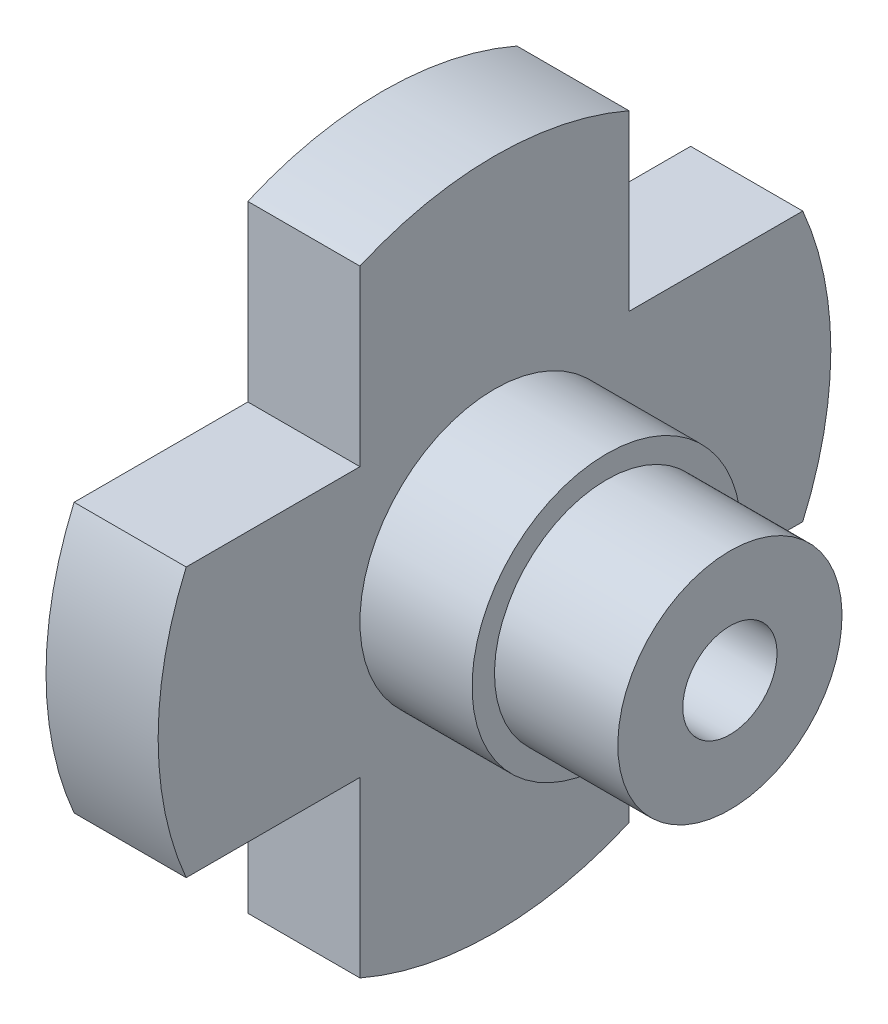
from build123d import *

# Parameters (mm, degrees)
M5_TAPPED_HOLE1_D = 4.2
EXTRUDE1_START    = -10
EXTRUDE1_DEPTH    = 10


with BuildPart() as part:
    # Sketch1 → Revolve1 (revolve)
    with BuildSketch(Plane.XY):
        Polygon((0, 0), (-15.5, 0), (-15.5, 15), (-10.5, 15), (-10.5, 6), (-5.5, 6), (-5.5, 5), (0, 5), align=None)
    revolve(axis=Axis((0, 0, 0), (-1, 0, 0)))

    # M5 Tapped Hole1 (through all)
    with Locations(Plane(origin=(-15.5, 0, 0), x_dir=(0, -1, 0), z_dir=(-1, 0, 0))):
        with Locations((0, 0)):
            Hole(M5_TAPPED_HOLE1_D / 2)

    # Sketch3 → Extrude1 (cut)
    with BuildSketch(Plane.ZY.offset(15.5).offset(EXTRUDE1_START)):
        with BuildLine():
            Line((13.747727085, 6), (18.181606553, 6))
            Line((18.181606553, 6), (6, 18.914427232))
            Line((6, 18.914427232), (6, 13.747727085))
            ThreePointArc((6, 13.747727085), (10.606601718, 10.606601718), (13.747727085, 6))
        make_face()
        with BuildLine():
            ThreePointArc((-13.747727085, 6), (-10.606601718, 10.606601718), (-6, 13.747727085))
            Line((-6, 13.747727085), (-6, 18.647126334))
            Line((-6, 18.647126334), (-18.705917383, 6))
            Line((-18.705917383, 6), (-13.747727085, 6))
        make_face()
        with BuildLine():
            Line((19.183984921, -6), (13.747727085, -6))
            ThreePointArc((13.747727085, -6), (10.606601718, -10.606601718), (6, -13.747727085))
            Line((6, -13.747727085), (6, -18.440873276))
            Line((6, -18.440873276), (19.183984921, -6))
        make_face()
        with BuildLine():
            ThreePointArc((-6, -13.747727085), (-10.606601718, -10.606601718), (-13.747727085, -6))
            Line((-13.747727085, -6), (-19.040043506, -6))
            Line((-19.040043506, -6), (-6, -18.5076985))
            Line((-6, -18.5076985), (-6, -13.747727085))
        make_face()
        with BuildLine():
            Line((-6, -13.747727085), (-6, -6))
            Line((-6, -6), (-13.747727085, -6))
            ThreePointArc((-13.747727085, -6), (-10.606601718, -10.606601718), (-6, -13.747727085))
        make_face()
        with BuildLine():
            Line((13.747727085, -6), (6, -6))
            Line((6, -6), (6, -13.747727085))
            ThreePointArc((6, -13.747727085), (10.606601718, -10.606601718), (13.747727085, -6))
        make_face()
        with BuildLine():
            Line((6, 6), (13.747727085, 6))
            ThreePointArc((13.747727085, 6), (10.606601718, 10.606601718), (6, 13.747727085))
            Line((6, 13.747727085), (6, 6))
        make_face()
        with BuildLine():
            Line((-13.747727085, 6), (-6, 6))
            Line((-6, 6), (-6, 13.747727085))
            ThreePointArc((-6, 13.747727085), (-10.606601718, 10.606601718), (-13.747727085, 6))
        make_face()
    extrude(amount=EXTRUDE1_DEPTH, mode=Mode.SUBTRACT)


solid = part.part
